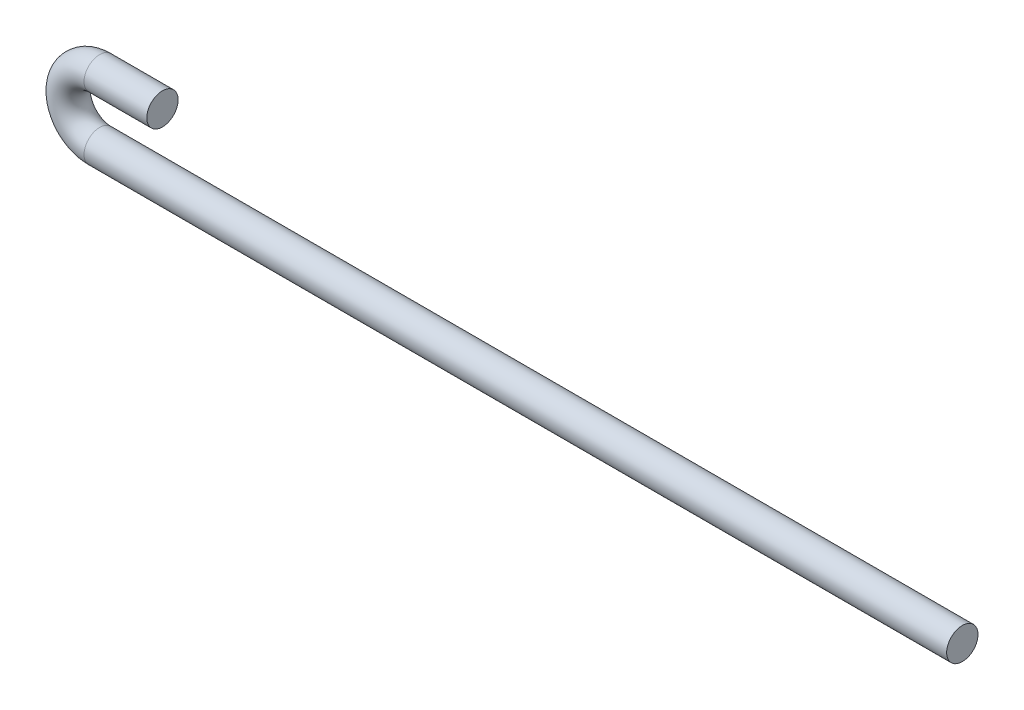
ISO-10303-21;
HEADER;
FILE_DESCRIPTION(('STEP AP214'),'2;1');
FILE_NAME('part.step','',(''),(''),'','','');
FILE_SCHEMA(('AUTOMOTIVE_DESIGN { 1 0 10303 214 1 1 1 1 }'));
ENDSEC;
DATA;
#1=APPLICATION_CONTEXT('core data for automotive mechanical design processes');
#2=APPLICATION_PROTOCOL_DEFINITION('international standard','automotive_design',2000,#1);
#3=PRODUCT_CONTEXT('',#1,'mechanical');
#4=PRODUCT('Part','Part','',(#3));
#5=PRODUCT_RELATED_PRODUCT_CATEGORY('part','',(#4));
#6=PRODUCT_DEFINITION_FORMATION('','',#4);
#7=PRODUCT_DEFINITION_CONTEXT('part definition',#1,'design');
#8=PRODUCT_DEFINITION('design','',#6,#7);
#9=PRODUCT_DEFINITION_SHAPE('','',#8);
#10=(LENGTH_UNIT() NAMED_UNIT(*) SI_UNIT(.MILLI.,.METRE.));
#11=(NAMED_UNIT(*) PLANE_ANGLE_UNIT() SI_UNIT($,.RADIAN.));
#12=(NAMED_UNIT(*) SI_UNIT($,.STERADIAN.) SOLID_ANGLE_UNIT());
#13=UNCERTAINTY_MEASURE_WITH_UNIT(LENGTH_MEASURE(1.E-05),#10,'distance_accuracy_value','');
#14=(GEOMETRIC_REPRESENTATION_CONTEXT(3) GLOBAL_UNCERTAINTY_ASSIGNED_CONTEXT((#13)) GLOBAL_UNIT_ASSIGNED_CONTEXT((#10,
#11,#12)) REPRESENTATION_CONTEXT('',''));
#15=CARTESIAN_POINT('',(0.,0.,0.));
#16=DIRECTION('',(0.,0.,1.));
#17=DIRECTION('',(1.,0.,0.));
#18=AXIS2_PLACEMENT_3D('',#15,#16,#17);
#19=CARTESIAN_POINT('',(-48.3442109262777,4.30944734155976,0.));
#20=DIRECTION('',(1.,0.,0.));
#21=DIRECTION('',(0.,0.,-1.));
#22=AXIS2_PLACEMENT_3D('',#19,#20,#21);
#23=CYLINDRICAL_SURFACE('',#22,0.79375);
#24=CARTESIAN_POINT('',(-48.3442109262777,4.30944734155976,0.));
#25=DIRECTION('',(1.,0.,0.));
#26=DIRECTION('',(0.,1.,0.));
#27=AXIS2_PLACEMENT_3D('',#24,#25,#26);
#28=CIRCLE('',#27,0.79375);
#29=CARTESIAN_POINT('',(-48.3442109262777,5.10319734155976,0.));
#30=VERTEX_POINT('',#29);
#31=EDGE_CURVE('E35',#30,#30,#28,.T.);
#32=ORIENTED_EDGE('',*,*,#31,.T.);
#33=EDGE_LOOP('',(#32));
#34=FACE_BOUND('',#33,.T.);
#35=CARTESIAN_POINT('',(-45.1692109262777,4.30944734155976,0.));
#36=DIRECTION('',(1.,0.,0.));
#37=DIRECTION('',(0.,1.,0.));
#38=AXIS2_PLACEMENT_3D('',#35,#36,#37);
#39=CIRCLE('',#38,0.79375);
#40=CARTESIAN_POINT('',(-45.1692109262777,5.10319734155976,0.));
#41=VERTEX_POINT('',#40);
#42=EDGE_CURVE('E10',#41,#41,#39,.T.);
#43=ORIENTED_EDGE('',*,*,#42,.F.);
#44=EDGE_LOOP('',(#43));
#45=FACE_BOUND('',#44,.T.);
#46=ADVANCED_FACE('F29',(#34,#45),#23,.T.);
#47=CARTESIAN_POINT('',(-48.3442109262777,2.71265892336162,0.));
#48=DIRECTION('',(0.,0.,-1.));
#49=DIRECTION('',(-1.,0.,0.));
#50=AXIS2_PLACEMENT_3D('',#47,#48,#49);
#51=TOROIDAL_SURFACE('',#50,1.59678841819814,0.79375);
#52=CARTESIAN_POINT('',(-48.3442109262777,1.11587050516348,0.));
#53=DIRECTION('',(-1.,0.,0.));
#54=DIRECTION('',(0.,-1.,0.));
#55=AXIS2_PLACEMENT_3D('',#52,#53,#54);
#56=CIRCLE('',#55,0.79375);
#57=CARTESIAN_POINT('',(-48.3442109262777,0.322120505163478,0.));
#58=VERTEX_POINT('',#57);
#59=EDGE_CURVE('E39',#58,#58,#56,.T.);
#60=CARTESIAN_POINT('',(-48.3442109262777,2.71265892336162,0.));
#61=DIRECTION('',(0.,0.,-1.));
#62=DIRECTION('',(-1.,0.,0.));
#63=AXIS2_PLACEMENT_3D('',#60,#61,#62);
#64=CIRCLE('',#63,2.39053841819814);
#65=EDGE_CURVE('',#58,#30,#64,.T.);
#66=ORIENTED_EDGE('',*,*,#59,.T.);
#67=ORIENTED_EDGE('',*,*,#31,.F.);
#68=ORIENTED_EDGE('',*,*,#65,.T.);
#69=ORIENTED_EDGE('',*,*,#65,.F.);
#70=EDGE_LOOP('',(#66,#68,#67,#69));
#71=FACE_BOUND('',#70,.T.);
#72=ADVANCED_FACE('F61',(#71),#51,.T.);
#73=CARTESIAN_POINT('',(-48.3442109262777,1.11587050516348,0.));
#74=DIRECTION('',(1.,0.,0.));
#75=DIRECTION('',(0.,1.,0.));
#76=AXIS2_PLACEMENT_3D('',#73,#74,#75);
#77=CYLINDRICAL_SURFACE('',#76,0.79375);
#78=ORIENTED_EDGE('',*,*,#59,.F.);
#79=EDGE_LOOP('',(#78));
#80=FACE_BOUND('',#79,.T.);
#81=CARTESIAN_POINT('',(-4.68796092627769,1.11587050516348,0.));
#82=DIRECTION('',(-1.,0.,0.));
#83=DIRECTION('',(0.,-1.,0.));
#84=AXIS2_PLACEMENT_3D('',#81,#82,#83);
#85=CIRCLE('',#84,0.79375);
#86=CARTESIAN_POINT('',(-4.68796092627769,0.322120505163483,0.));
#87=VERTEX_POINT('',#86);
#88=EDGE_CURVE('E43',#87,#87,#85,.T.);
#89=ORIENTED_EDGE('',*,*,#88,.T.);
#90=EDGE_LOOP('',(#89));
#91=FACE_BOUND('',#90,.T.);
#92=ADVANCED_FACE('F49',(#80,#91),#77,.T.);
#93=CARTESIAN_POINT('',(-45.1692109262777,4.30944734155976,0.));
#94=DIRECTION('',(1.,0.,0.));
#95=DIRECTION('',(0.,1.,0.));
#96=AXIS2_PLACEMENT_3D('',#93,#94,#95);
#97=PLANE('',#96);
#98=ORIENTED_EDGE('',*,*,#42,.T.);
#99=EDGE_LOOP('',(#98));
#100=FACE_BOUND('',#99,.T.);
#101=ADVANCED_FACE('F53',(#100),#97,.T.);
#102=CARTESIAN_POINT('',(-4.68796092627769,1.11587050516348,0.));
#103=DIRECTION('',(-1.,0.,0.));
#104=DIRECTION('',(0.,-1.,0.));
#105=AXIS2_PLACEMENT_3D('',#102,#103,#104);
#106=PLANE('',#105);
#107=ORIENTED_EDGE('',*,*,#88,.F.);
#108=EDGE_LOOP('',(#107));
#109=FACE_BOUND('',#108,.T.);
#110=ADVANCED_FACE('F51',(#109),#106,.F.);
#111=CLOSED_SHELL('',(#46,#72,#92,#101,#110));
#112=MANIFOLD_SOLID_BREP('B2',#111);
#113=ADVANCED_BREP_SHAPE_REPRESENTATION('',(#18,#112),#14);
#114=SHAPE_DEFINITION_REPRESENTATION(#9,#113);
ENDSEC;
END-ISO-10303-21;
